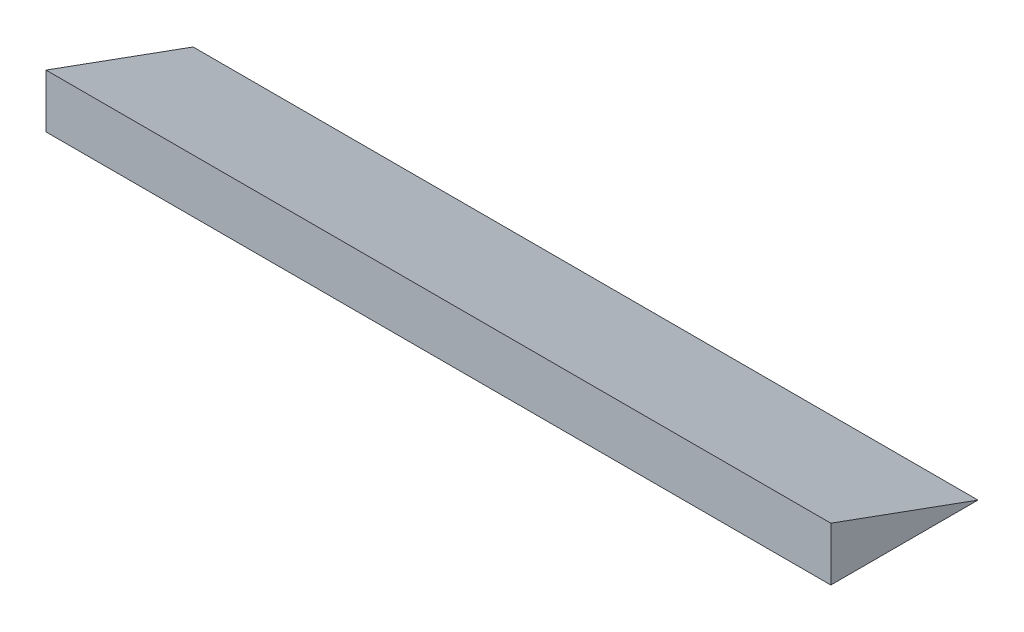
ISO-10303-21;
HEADER;
FILE_DESCRIPTION(('STEP AP214'),'2;1');
FILE_NAME('part.step','',(''),(''),'','','');
FILE_SCHEMA(('AUTOMOTIVE_DESIGN { 1 0 10303 214 1 1 1 1 }'));
ENDSEC;
DATA;
#1=APPLICATION_CONTEXT('core data for automotive mechanical design processes');
#2=APPLICATION_PROTOCOL_DEFINITION('international standard','automotive_design',2000,#1);
#3=PRODUCT_CONTEXT('',#1,'mechanical');
#4=PRODUCT('Part','Part','',(#3));
#5=PRODUCT_RELATED_PRODUCT_CATEGORY('part','',(#4));
#6=PRODUCT_DEFINITION_FORMATION('','',#4);
#7=PRODUCT_DEFINITION_CONTEXT('part definition',#1,'design');
#8=PRODUCT_DEFINITION('design','',#6,#7);
#9=PRODUCT_DEFINITION_SHAPE('','',#8);
#10=(LENGTH_UNIT() NAMED_UNIT(*) SI_UNIT(.MILLI.,.METRE.));
#11=(NAMED_UNIT(*) PLANE_ANGLE_UNIT() SI_UNIT($,.RADIAN.));
#12=(NAMED_UNIT(*) SI_UNIT($,.STERADIAN.) SOLID_ANGLE_UNIT());
#13=UNCERTAINTY_MEASURE_WITH_UNIT(LENGTH_MEASURE(1.E-05),#10,'distance_accuracy_value','');
#14=(GEOMETRIC_REPRESENTATION_CONTEXT(3) GLOBAL_UNCERTAINTY_ASSIGNED_CONTEXT((#13)) GLOBAL_UNIT_ASSIGNED_CONTEXT((#10,
#11,#12)) REPRESENTATION_CONTEXT('',''));
#15=CARTESIAN_POINT('',(0.,0.,0.));
#16=DIRECTION('',(0.,0.,1.));
#17=DIRECTION('',(1.,0.,0.));
#18=AXIS2_PLACEMENT_3D('',#15,#16,#17);
#19=CARTESIAN_POINT('',(1600.,0.,0.));
#20=DIRECTION('',(0.,0.,-1.));
#21=DIRECTION('',(0.,1.,0.));
#22=AXIS2_PLACEMENT_3D('',#19,#20,#21);
#23=PLANE('',#22);
#24=DIRECTION('',(0.,-1.,0.));
#25=VECTOR('',#24,1.);
#26=CARTESIAN_POINT('',(0.,0.,0.));
#27=LINE('',#26,#25);
#28=CARTESIAN_POINT('',(0.,109.191070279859,0.));
#29=VERTEX_POINT('',#28);
#30=CARTESIAN_POINT('',(0.,0.,0.));
#31=VERTEX_POINT('',#30);
#32=EDGE_CURVE('E84',#29,#31,#27,.T.);
#33=ORIENTED_EDGE('',*,*,#32,.T.);
#34=DIRECTION('',(-1.,0.,0.));
#35=VECTOR('',#34,1.);
#36=CARTESIAN_POINT('',(1600.,0.,0.));
#37=LINE('',#36,#35);
#38=CARTESIAN_POINT('',(1600.,0.,0.));
#39=VERTEX_POINT('',#38);
#40=EDGE_CURVE('E11',#39,#31,#37,.T.);
#41=ORIENTED_EDGE('',*,*,#40,.F.);
#42=DIRECTION('',(0.,-1.,0.));
#43=VECTOR('',#42,1.);
#44=CARTESIAN_POINT('',(1600.,0.,0.));
#45=LINE('',#44,#43);
#46=CARTESIAN_POINT('',(1600.,109.191070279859,0.));
#47=VERTEX_POINT('',#46);
#48=EDGE_CURVE('E77',#47,#39,#45,.T.);
#49=ORIENTED_EDGE('',*,*,#48,.F.);
#50=DIRECTION('',(-1.,0.,0.));
#51=VECTOR('',#50,1.);
#52=CARTESIAN_POINT('',(1600.,109.191070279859,0.));
#53=LINE('',#52,#51);
#54=EDGE_CURVE('E85',#47,#29,#53,.T.);
#55=ORIENTED_EDGE('',*,*,#54,.T.);
#56=EDGE_LOOP('',(#33,#41,#49,#55));
#57=FACE_BOUND('',#56,.T.);
#58=ADVANCED_FACE('F37',(#57),#23,.F.);
#59=CARTESIAN_POINT('',(1600.,0.,0.));
#60=DIRECTION('',(0.,1.,0.));
#61=DIRECTION('',(0.,0.,1.));
#62=AXIS2_PLACEMENT_3D('',#59,#60,#61);
#63=PLANE('',#62);
#64=CARTESIAN_POINT('',(1050.,0.,-150.));
#65=DIRECTION('',(0.,-1.,0.));
#66=DIRECTION('',(0.,0.,1.));
#67=AXIS2_PLACEMENT_3D('',#64,#65,#66);
#68=CIRCLE('',#67,5.00000000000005);
#69=CARTESIAN_POINT('',(1050.,0.,-145.));
#70=VERTEX_POINT('',#69);
#71=EDGE_CURVE('E121',#70,#70,#68,.T.);
#72=ORIENTED_EDGE('',*,*,#71,.F.);
#73=EDGE_LOOP('',(#72));
#74=FACE_BOUND('',#73,.T.);
#75=CARTESIAN_POINT('',(550.,0.,-150.));
#76=DIRECTION('',(0.,-1.,0.));
#77=DIRECTION('',(0.,0.,-1.));
#78=AXIS2_PLACEMENT_3D('',#75,#76,#77);
#79=CIRCLE('',#78,5.00000000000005);
#80=CARTESIAN_POINT('',(550.,0.,-155.));
#81=VERTEX_POINT('',#80);
#82=EDGE_CURVE('E91',#81,#81,#79,.T.);
#83=ORIENTED_EDGE('',*,*,#82,.F.);
#84=EDGE_LOOP('',(#83));
#85=FACE_BOUND('',#84,.T.);
#86=DIRECTION('',(0.,0.,-1.));
#87=VECTOR('',#86,1.);
#88=CARTESIAN_POINT('',(0.,0.,0.));
#89=LINE('',#88,#87);
#90=CARTESIAN_POINT('',(0.,0.,-300.));
#91=VERTEX_POINT('',#90);
#92=EDGE_CURVE('E65',#31,#91,#89,.T.);
#93=ORIENTED_EDGE('',*,*,#92,.T.);
#94=DIRECTION('',(-1.,0.,0.));
#95=VECTOR('',#94,1.);
#96=CARTESIAN_POINT('',(1600.,0.,-300.));
#97=LINE('',#96,#95);
#98=CARTESIAN_POINT('',(1600.,0.,-300.));
#99=VERTEX_POINT('',#98);
#100=EDGE_CURVE('E45',#99,#91,#97,.T.);
#101=ORIENTED_EDGE('',*,*,#100,.F.);
#102=DIRECTION('',(0.,0.,-1.));
#103=VECTOR('',#102,1.);
#104=CARTESIAN_POINT('',(1600.,0.,0.));
#105=LINE('',#104,#103);
#106=EDGE_CURVE('E73',#39,#99,#105,.T.);
#107=ORIENTED_EDGE('',*,*,#106,.F.);
#108=ORIENTED_EDGE('',*,*,#40,.T.);
#109=EDGE_LOOP('',(#93,#101,#107,#108));
#110=FACE_BOUND('',#109,.T.);
#111=ADVANCED_FACE('F74',(#74,#85,#110),#63,.F.);
#112=CARTESIAN_POINT('',(1600.,0.,-300.));
#113=DIRECTION('',(0.,-0.939692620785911,0.342020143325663));
#114=DIRECTION('',(0.,-0.342020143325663,-0.939692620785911));
#115=AXIS2_PLACEMENT_3D('',#112,#113,#114);
#116=PLANE('',#115);
#117=DIRECTION('',(0.,0.342020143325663,0.939692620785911));
#118=VECTOR('',#117,1.);
#119=CARTESIAN_POINT('',(0.,0.,-300.));
#120=LINE('',#119,#118);
#121=EDGE_CURVE('E70',#91,#29,#120,.T.);
#122=ORIENTED_EDGE('',*,*,#121,.T.);
#123=ORIENTED_EDGE('',*,*,#54,.F.);
#124=DIRECTION('',(0.,0.342020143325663,0.939692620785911));
#125=VECTOR('',#124,1.);
#126=CARTESIAN_POINT('',(1600.,0.,-300.));
#127=LINE('',#126,#125);
#128=EDGE_CURVE('E53',#99,#47,#127,.T.);
#129=ORIENTED_EDGE('',*,*,#128,.F.);
#130=ORIENTED_EDGE('',*,*,#100,.T.);
#131=EDGE_LOOP('',(#122,#123,#129,#130));
#132=FACE_BOUND('',#131,.T.);
#133=ADVANCED_FACE('F96',(#132),#116,.F.);
#134=CARTESIAN_POINT('',(1600.,0.,0.));
#135=DIRECTION('',(-1.,0.,0.));
#136=DIRECTION('',(0.,0.,1.));
#137=AXIS2_PLACEMENT_3D('',#134,#135,#136);
#138=PLANE('',#137);
#139=ORIENTED_EDGE('',*,*,#48,.T.);
#140=ORIENTED_EDGE('',*,*,#106,.T.);
#141=ORIENTED_EDGE('',*,*,#128,.T.);
#142=EDGE_LOOP('',(#139,#140,#141));
#143=FACE_BOUND('',#142,.T.);
#144=ADVANCED_FACE('F80',(#143),#138,.F.);
#145=CARTESIAN_POINT('',(0.,0.,0.));
#146=DIRECTION('',(-1.,0.,0.));
#147=DIRECTION('',(0.,0.,1.));
#148=AXIS2_PLACEMENT_3D('',#145,#146,#147);
#149=PLANE('',#148);
#150=ORIENTED_EDGE('',*,*,#32,.F.);
#151=ORIENTED_EDGE('',*,*,#121,.F.);
#152=ORIENTED_EDGE('',*,*,#92,.F.);
#153=EDGE_LOOP('',(#150,#151,#152));
#154=FACE_BOUND('',#153,.T.);
#155=ADVANCED_FACE('F97',(#154),#149,.T.);
#156=CARTESIAN_POINT('',(550.,10.,-150.));
#157=DIRECTION('',(0.,-1.,0.));
#158=DIRECTION('',(0.,0.,-1.));
#159=AXIS2_PLACEMENT_3D('',#156,#157,#158);
#160=CYLINDRICAL_SURFACE('',#159,5.00000000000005);
#161=CARTESIAN_POINT('',(550.,10.,-150.));
#162=DIRECTION('',(0.,-1.,0.));
#163=DIRECTION('',(0.,0.,-1.));
#164=AXIS2_PLACEMENT_3D('',#161,#162,#163);
#165=CIRCLE('',#164,5.00000000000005);
#166=CARTESIAN_POINT('',(550.,10.,-155.));
#167=VERTEX_POINT('',#166);
#168=EDGE_CURVE('E87',#167,#167,#165,.T.);
#169=ORIENTED_EDGE('',*,*,#168,.F.);
#170=EDGE_LOOP('',(#169));
#171=FACE_BOUND('',#170,.T.);
#172=ORIENTED_EDGE('',*,*,#82,.T.);
#173=EDGE_LOOP('',(#172));
#174=FACE_BOUND('',#173,.T.);
#175=ADVANCED_FACE('F99',(#171,#174),#160,.F.);
#176=CARTESIAN_POINT('',(550.,10.,-150.));
#177=DIRECTION('',(0.,-1.,0.));
#178=DIRECTION('',(0.,0.,-1.));
#179=AXIS2_PLACEMENT_3D('',#176,#177,#178);
#180=PLANE('',#179);
#181=ORIENTED_EDGE('',*,*,#168,.T.);
#182=EDGE_LOOP('',(#181));
#183=FACE_BOUND('',#182,.T.);
#184=ADVANCED_FACE('F105',(#183),#180,.T.);
#185=CARTESIAN_POINT('',(1050.,10.,-150.));
#186=DIRECTION('',(0.,-1.,0.));
#187=DIRECTION('',(0.,0.,-1.));
#188=AXIS2_PLACEMENT_3D('',#185,#186,#187);
#189=CYLINDRICAL_SURFACE('',#188,5.00000000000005);
#190=CARTESIAN_POINT('',(1050.,10.,-150.));
#191=DIRECTION('',(0.,-1.,0.));
#192=DIRECTION('',(0.,0.,1.));
#193=AXIS2_PLACEMENT_3D('',#190,#191,#192);
#194=CIRCLE('',#193,5.00000000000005);
#195=CARTESIAN_POINT('',(1050.,10.,-145.));
#196=VERTEX_POINT('',#195);
#197=EDGE_CURVE('E125',#196,#196,#194,.T.);
#198=ORIENTED_EDGE('',*,*,#197,.F.);
#199=EDGE_LOOP('',(#198));
#200=FACE_BOUND('',#199,.T.);
#201=ORIENTED_EDGE('',*,*,#71,.T.);
#202=EDGE_LOOP('',(#201));
#203=FACE_BOUND('',#202,.T.);
#204=ADVANCED_FACE('F131',(#200,#203),#189,.F.);
#205=CARTESIAN_POINT('',(1050.,10.,-150.));
#206=DIRECTION('',(0.,1.,0.));
#207=DIRECTION('',(0.,0.,1.));
#208=AXIS2_PLACEMENT_3D('',#205,#206,#207);
#209=PLANE('',#208);
#210=ORIENTED_EDGE('',*,*,#197,.T.);
#211=EDGE_LOOP('',(#210));
#212=FACE_BOUND('',#211,.T.);
#213=ADVANCED_FACE('F133',(#212),#209,.F.);
#214=CLOSED_SHELL('',(#58,#111,#133,#144,#155,#175,#184,#204,#213));
#215=MANIFOLD_SOLID_BREP('B2',#214);
#216=ADVANCED_BREP_SHAPE_REPRESENTATION('',(#18,#215),#14);
#217=SHAPE_DEFINITION_REPRESENTATION(#9,#216);
ENDSEC;
END-ISO-10303-21;
